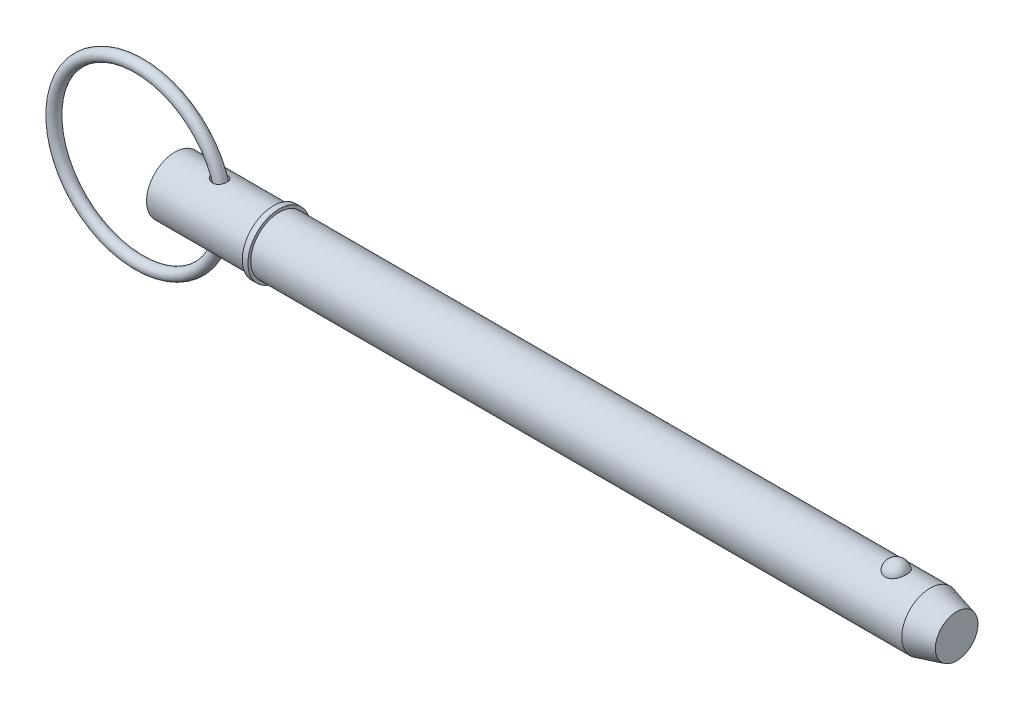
ISO-10303-21;
HEADER;
FILE_DESCRIPTION(('STEP AP214'),'2;1');
FILE_NAME('part.step','',(''),(''),'','','');
FILE_SCHEMA(('AUTOMOTIVE_DESIGN { 1 0 10303 214 1 1 1 1 }'));
ENDSEC;
DATA;
#1=APPLICATION_CONTEXT('core data for automotive mechanical design processes');
#2=APPLICATION_PROTOCOL_DEFINITION('international standard','automotive_design',2000,#1);
#3=PRODUCT_CONTEXT('',#1,'mechanical');
#4=PRODUCT('Part','Part','',(#3));
#5=PRODUCT_RELATED_PRODUCT_CATEGORY('part','',(#4));
#6=PRODUCT_DEFINITION_FORMATION('','',#4);
#7=PRODUCT_DEFINITION_CONTEXT('part definition',#1,'design');
#8=PRODUCT_DEFINITION('design','',#6,#7);
#9=PRODUCT_DEFINITION_SHAPE('','',#8);
#10=(LENGTH_UNIT() NAMED_UNIT(*) SI_UNIT(.MILLI.,.METRE.));
#11=(NAMED_UNIT(*) PLANE_ANGLE_UNIT() SI_UNIT($,.RADIAN.));
#12=(NAMED_UNIT(*) SI_UNIT($,.STERADIAN.) SOLID_ANGLE_UNIT());
#13=UNCERTAINTY_MEASURE_WITH_UNIT(LENGTH_MEASURE(1.E-05),#10,'distance_accuracy_value','');
#14=(GEOMETRIC_REPRESENTATION_CONTEXT(3) GLOBAL_UNCERTAINTY_ASSIGNED_CONTEXT((#13)) GLOBAL_UNIT_ASSIGNED_CONTEXT((#10,
#11,#12)) REPRESENTATION_CONTEXT('',''));
#15=CARTESIAN_POINT('',(0.,0.,0.));
#16=DIRECTION('',(0.,0.,1.));
#17=DIRECTION('',(1.,0.,0.));
#18=AXIS2_PLACEMENT_3D('',#15,#16,#17);
#19=CARTESIAN_POINT('',(-11.9894358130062,0.,0.));
#20=DIRECTION('',(0.,0.,1.));
#21=DIRECTION('',(1.,0.,0.));
#22=AXIS2_PLACEMENT_3D('',#19,#20,#21);
#23=TOROIDAL_SURFACE('',#22,28.575,1.905);
#24=CARTESIAN_POINT('',(18.4905641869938,0.,0.));
#25=VERTEX_POINT('',#24);
#26=VERTEX_LOOP('',#25);
#27=FACE_BOUND('',#26,.T.);
#28=ADVANCED_FACE('P0_F12',(#27),#23,.T.);
#29=CLOSED_SHELL('',(#28));
#30=MANIFOLD_SOLID_BREP('P0_B1',#29);
#31=CARTESIAN_POINT('',(0.,0.,0.));
#32=DIRECTION('',(1.,0.,0.));
#33=DIRECTION('',(0.,0.,-1.));
#34=AXIS2_PLACEMENT_3D('',#31,#32,#33);
#35=CYLINDRICAL_SURFACE('',#34,9.525);
#36=CARTESIAN_POINT('',(12.9513882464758,9.41921920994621,-1.41559473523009));
#37=CARTESIAN_POINT('',(13.0504692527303,9.40163924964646,-1.53256769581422));
#38=CARTESIAN_POINT('',(13.1602600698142,9.38319823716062,-1.6404459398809));
#39=CARTESIAN_POINT('',(13.3966485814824,9.34687220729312,-1.83618480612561));
#40=CARTESIAN_POINT('',(13.5232761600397,9.32898824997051,-1.92400906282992));
#41=CARTESIAN_POINT('',(13.78900694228,9.29593183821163,-2.07784697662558));
#42=CARTESIAN_POINT('',(13.9280753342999,9.28075215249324,-2.14391921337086));
#43=CARTESIAN_POINT('',(14.2153444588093,9.25488828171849,-2.25295850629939));
#44=CARTESIAN_POINT('',(14.3635415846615,9.24420233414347,-2.29593462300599));
#45=CARTESIAN_POINT('',(14.669669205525,9.22859713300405,-2.3579005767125));
#46=CARTESIAN_POINT('',(14.8277567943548,9.22385123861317,-2.37617053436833));
#47=CARTESIAN_POINT('',(15.1447573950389,9.22170813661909,-2.38448481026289));
#48=CARTESIAN_POINT('',(15.3036699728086,9.22430739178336,-2.3745427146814));
#49=CARTESIAN_POINT('',(15.6046561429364,9.2363636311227,-2.32717331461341));
#50=CARTESIAN_POINT('',(15.7470893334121,9.24528216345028,-2.29190131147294));
#51=CARTESIAN_POINT('',(16.0228763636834,9.26842607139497,-2.19642882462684));
#52=CARTESIAN_POINT('',(16.1562346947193,9.28264879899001,-2.1362407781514));
#53=CARTESIAN_POINT('',(16.3991522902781,9.31332263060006,-1.99805318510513));
#54=CARTESIAN_POINT('',(16.5097585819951,9.32951023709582,-1.92182839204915));
#55=CARTESIAN_POINT('',(16.7159974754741,9.36298467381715,-1.75147176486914));
#56=CARTESIAN_POINT('',(16.811631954,9.38027136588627,-1.65734217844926));
#57=CARTESIAN_POINT('',(16.9833240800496,9.41356881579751,-1.45618916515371));
#58=CARTESIAN_POINT('',(17.0597719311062,9.42959946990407,-1.34950141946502));
#59=CARTESIAN_POINT('',(17.1939538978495,9.45905380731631,-1.12462011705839));
#60=CARTESIAN_POINT('',(17.2516877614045,9.4724774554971,-1.00642640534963));
#61=CARTESIAN_POINT('',(17.3474400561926,9.49535683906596,-0.760990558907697));
#62=CARTESIAN_POINT('',(17.3853184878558,9.50478431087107,-0.633691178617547));
#63=CARTESIAN_POINT('',(17.4399027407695,9.51852575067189,-0.374363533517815));
#64=CARTESIAN_POINT('',(17.4566077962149,9.52283953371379,-0.242335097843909));
#65=CARTESIAN_POINT('',(17.4685150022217,9.52590431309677,0.0235692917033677));
#66=CARTESIAN_POINT('',(17.4635842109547,9.52462091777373,0.157451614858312));
#67=CARTESIAN_POINT('',(17.4320243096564,9.5165501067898,0.422467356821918));
#68=CARTESIAN_POINT('',(17.4053947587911,9.50976257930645,0.55360071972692));
#69=CARTESIAN_POINT('',(17.3310009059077,9.49140797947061,0.809490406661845));
#70=CARTESIAN_POINT('',(17.2832204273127,9.47983724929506,0.934241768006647));
#71=CARTESIAN_POINT('',(17.1676219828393,9.453180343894,1.1736825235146));
#72=CARTESIAN_POINT('',(17.0998044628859,9.43809424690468,1.28837214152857));
#73=CARTESIAN_POINT('',(16.9461013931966,9.40614962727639,1.50393386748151));
#74=CARTESIAN_POINT('',(16.8602910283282,9.38929862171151,1.6048606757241));
#75=CARTESIAN_POINT('',(16.6726759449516,9.35566510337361,1.79055313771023));
#76=CARTESIAN_POINT('',(16.5708731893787,9.33888258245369,1.87532077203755));
#77=CARTESIAN_POINT('',(16.3550631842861,9.30741331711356,2.02572386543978));
#78=CARTESIAN_POINT('',(16.2411701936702,9.29270956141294,2.09151983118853));
#79=CARTESIAN_POINT('',(16.0037488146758,9.26681293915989,2.20343355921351));
#80=CARTESIAN_POINT('',(15.8802207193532,9.25561996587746,2.24955191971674));
#81=CARTESIAN_POINT('',(15.6262451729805,9.23779438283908,2.32167613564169));
#82=CARTESIAN_POINT('',(15.4957570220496,9.23119272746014,2.34754561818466));
#83=CARTESIAN_POINT('',(15.2322153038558,9.22318493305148,2.37881082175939));
#84=CARTESIAN_POINT('',(15.0991611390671,9.22178001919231,2.38420171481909));
#85=CARTESIAN_POINT('',(14.8267609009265,9.22414647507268,2.37503099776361));
#86=CARTESIAN_POINT('',(14.6874545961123,9.22819578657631,2.35939810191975));
#87=CARTESIAN_POINT('',(14.412976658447,9.24129253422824,2.30756034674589));
#88=CARTESIAN_POINT('',(14.2778066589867,9.25034191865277,2.27134746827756));
#89=CARTESIAN_POINT('',(14.0027915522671,9.27334688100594,2.1756145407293));
#90=CARTESIAN_POINT('',(13.8635960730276,9.28766658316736,2.11431132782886));
#91=CARTESIAN_POINT('',(13.5969045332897,9.31925368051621,1.97041856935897));
#92=CARTESIAN_POINT('',(13.4694182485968,9.33652350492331,1.88781145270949));
#93=CARTESIAN_POINT('',(13.2243568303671,9.37286659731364,1.69844580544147));
#94=CARTESIAN_POINT('',(13.1075060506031,9.39198626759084,1.59075211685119));
#95=CARTESIAN_POINT('',(12.8957171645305,9.42881110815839,1.35544651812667));
#96=CARTESIAN_POINT('',(12.8007455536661,9.44651841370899,1.22786557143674));
#97=CARTESIAN_POINT('',(12.6580495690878,9.4741137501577,0.9887243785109));
#98=CARTESIAN_POINT('',(12.604453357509,9.4848570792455,0.880756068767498));
#99=CARTESIAN_POINT('',(12.515693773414,9.50295777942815,0.657225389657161));
#100=CARTESIAN_POINT('',(12.4805142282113,9.51031812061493,0.541669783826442));
#101=CARTESIAN_POINT('',(12.4305797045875,9.52083647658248,0.305475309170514));
#102=CARTESIAN_POINT('',(12.4159122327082,9.52397648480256,0.18481691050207));
#103=CARTESIAN_POINT('',(12.408320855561,9.52559626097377,-0.0572308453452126));
#104=CARTESIAN_POINT('',(12.4153963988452,9.52407614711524,-0.178620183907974));
#105=CARTESIAN_POINT('',(12.4495068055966,9.51684301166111,-0.409566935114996));
#106=CARTESIAN_POINT('',(12.4750931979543,9.51143444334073,-0.519353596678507));
#107=CARTESIAN_POINT('',(12.543120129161,9.49733710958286,-0.73328523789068));
#108=CARTESIAN_POINT('',(12.5855568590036,9.4886490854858,-0.837431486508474));
#109=CARTESIAN_POINT('',(12.6780792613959,9.47023833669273,-1.02356028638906));
#110=CARTESIAN_POINT('',(12.7261842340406,9.46084463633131,-1.10657511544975));
#111=CARTESIAN_POINT('',(12.8319313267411,9.44081892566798,-1.26610577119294));
#112=CARTESIAN_POINT('',(12.8895756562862,9.43018662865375,-1.34262008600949));
#113=CARTESIAN_POINT('',(12.9513882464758,9.41921920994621,-1.41559473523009));
#114=B_SPLINE_CURVE_WITH_KNOTS('',3,(#36,#37,#38,#39,#40,#41,#42,#43,#44,#45,#46,#47,#48,#49,
#50,#51,#52,#53,#54,#55,#56,#57,#58,#59,#60,#61,#62,#63,#64,#65,#66,#67,#68,#69,#70,#71,#72,#73,
#74,#75,#76,#77,#78,#79,#80,#81,#82,#83,#84,#85,#86,#87,#88,#89,#90,#91,#92,#93,#94,#95,#96,#97,
#98,#99,#100,#101,#102,#103,#104,#105,#106,#107,#108,#109,#110,#111,#112,#113),.UNSPECIFIED.,
.T.,.F.,(4,2,2,2,2,2,2,2,2,2,2,2,2,2,2,2,2,2,2,2,2,2,2,2,2,2,2,2,2,2,2,2,2,2,2,2,2,2,4),(0.,
0.462524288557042,0.925880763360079,1.3879789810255,1.8498957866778,2.3250010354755,
2.79987752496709,3.23851602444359,3.67693583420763,4.08084875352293,4.48471100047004,
4.87953549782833,5.27436531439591,5.67194282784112,6.0695347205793,6.46957303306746,
6.86961947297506,7.26997240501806,7.67031642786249,8.06901977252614,8.46767421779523,
8.86284969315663,9.25801315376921,9.65581560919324,10.0537118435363,10.4726706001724,
10.8917927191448,11.3481090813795,11.8048030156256,12.2824769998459,12.7594145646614,
13.1209614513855,13.4821903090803,13.8449555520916,14.2077115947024,14.5447865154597,
14.881785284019,15.170268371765,15.4588183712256),.UNSPECIFIED.);
#115=CARTESIAN_POINT('',(12.9513882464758,9.41921920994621,-1.41559473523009));
#116=VERTEX_POINT('',#115);
#117=EDGE_CURVE('P1_E42',#116,#116,#114,.T.);
#118=ORIENTED_EDGE('',*,*,#117,.T.);
#119=EDGE_LOOP('',(#118));
#120=FACE_BOUND('',#119,.T.);
#121=CARTESIAN_POINT('',(0.,0.,0.));
#122=DIRECTION('',(1.,0.,0.));
#123=DIRECTION('',(0.,0.,-1.));
#124=AXIS2_PLACEMENT_3D('',#121,#122,#123);
#125=CIRCLE('',#124,9.525);
#126=CARTESIAN_POINT('',(0.,0.,-9.525));
#127=VERTEX_POINT('',#126);
#128=EDGE_CURVE('P1_E9',#127,#127,#125,.T.);
#129=ORIENTED_EDGE('',*,*,#128,.T.);
#130=EDGE_LOOP('',(#129));
#131=FACE_BOUND('',#130,.T.);
#132=CARTESIAN_POINT('',(33.025,0.,0.));
#133=DIRECTION('',(1.,0.,0.));
#134=DIRECTION('',(0.,0.,-1.));
#135=AXIS2_PLACEMENT_3D('',#132,#133,#134);
#136=CIRCLE('',#135,9.525);
#137=CARTESIAN_POINT('',(33.025,0.,-9.525));
#138=VERTEX_POINT('',#137);
#139=EDGE_CURVE('P1_E25',#138,#138,#136,.T.);
#140=ORIENTED_EDGE('',*,*,#139,.F.);
#141=EDGE_LOOP('',(#140));
#142=FACE_BOUND('',#141,.T.);
#143=CARTESIAN_POINT('',(12.9513882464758,-9.41921920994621,-1.41559473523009));
#144=CARTESIAN_POINT('',(12.8706569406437,-9.43354320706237,-1.32028288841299));
#145=CARTESIAN_POINT('',(12.7970077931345,-9.44729974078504,-1.21890449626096));
#146=CARTESIAN_POINT('',(12.6667099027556,-9.47239055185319,-1.00546491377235));
#147=CARTESIAN_POINT('',(12.6100480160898,-9.48372669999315,-0.893412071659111));
#148=CARTESIAN_POINT('',(12.5163428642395,-9.50281544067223,-0.66020233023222));
#149=CARTESIAN_POINT('',(12.4794216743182,-9.51054569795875,-0.538993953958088));
#150=CARTESIAN_POINT('',(12.4282252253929,-9.52133525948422,-0.29167282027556));
#151=CARTESIAN_POINT('',(12.4139371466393,-9.52439720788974,-0.165562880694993));
#152=CARTESIAN_POINT('',(12.4092595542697,-9.52539668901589,0.0763263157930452));
#153=CARTESIAN_POINT('',(12.4169377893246,-9.5237485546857,0.192070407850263));
#154=CARTESIAN_POINT('',(12.4515961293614,-9.51640070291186,0.420478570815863));
#155=CARTESIAN_POINT('',(12.4785770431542,-9.51070081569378,0.533142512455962));
#156=CARTESIAN_POINT('',(12.5496371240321,-9.49599978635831,0.750537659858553));
#157=CARTESIAN_POINT('',(12.5934215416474,-9.48705569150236,0.855370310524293));
#158=CARTESIAN_POINT('',(12.6960201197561,-9.46670226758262,1.05710432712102));
#159=CARTESIAN_POINT('',(12.754838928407,-9.45529217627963,1.15400322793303));
#160=CARTESIAN_POINT('',(12.8926588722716,-9.42958102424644,1.34883014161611));
#161=CARTESIAN_POINT('',(12.9731843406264,-9.41509922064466,1.44565277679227));
#162=CARTESIAN_POINT('',(13.1473692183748,-9.38554264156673,1.62653953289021));
#163=CARTESIAN_POINT('',(13.2410364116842,-9.37046751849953,1.71059603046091));
#164=CARTESIAN_POINT('',(13.4543924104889,-9.33867330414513,1.87697964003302));
#165=CARTESIAN_POINT('',(13.5758667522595,-9.32205896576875,1.95704323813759));
#166=CARTESIAN_POINT('',(13.8299208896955,-9.29140277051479,2.09777392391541));
#167=CARTESIAN_POINT('',(13.9625074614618,-9.27736250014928,2.15842906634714));
#168=CARTESIAN_POINT('',(14.2477938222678,-9.25234849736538,2.26337318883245));
#169=CARTESIAN_POINT('',(14.4012368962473,-9.2417532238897,2.30575283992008));
#170=CARTESIAN_POINT('',(14.7134258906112,-9.22706044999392,2.36387471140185));
#171=CARTESIAN_POINT('',(14.8721705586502,-9.22296142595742,2.37962317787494));
#172=CARTESIAN_POINT('',(15.1841930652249,-9.22219798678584,2.38258156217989));
#173=CARTESIAN_POINT('',(15.3374581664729,-9.22526675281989,2.37081567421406));
#174=CARTESIAN_POINT('',(15.6390558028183,-9.23821642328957,2.31984408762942));
#175=CARTESIAN_POINT('',(15.7873916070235,-9.24809271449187,2.28065697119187));
#176=CARTESIAN_POINT('',(16.0605055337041,-9.27231045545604,2.17997072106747));
#177=CARTESIAN_POINT('',(16.1861988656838,-9.28616347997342,2.12082794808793));
#178=CARTESIAN_POINT('',(16.4248737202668,-9.31689725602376,1.9814435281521));
#179=CARTESIAN_POINT('',(16.5378583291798,-9.33377726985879,1.90120701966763));
#180=CARTESIAN_POINT('',(16.7424913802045,-9.36766057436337,1.72629138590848));
#181=CARTESIAN_POINT('',(16.8349077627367,-9.38461836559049,1.63249912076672));
#182=CARTESIAN_POINT('',(17.0025959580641,-9.41752009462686,1.43052052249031));
#183=CARTESIAN_POINT('',(17.0778684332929,-9.43346407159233,1.32233474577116));
#184=CARTESIAN_POINT('',(17.2093311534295,-9.46256896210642,1.09477833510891));
#185=CARTESIAN_POINT('',(17.2655443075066,-9.47573320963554,0.975421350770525));
#186=CARTESIAN_POINT('',(17.3577240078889,-9.49788660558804,0.728764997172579));
#187=CARTESIAN_POINT('',(17.3936897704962,-9.5068755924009,0.601465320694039));
#188=CARTESIAN_POINT('',(17.4447894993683,-9.51977728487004,0.341392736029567));
#189=CARTESIAN_POINT('',(17.4597470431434,-9.52364698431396,0.208583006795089));
#190=CARTESIAN_POINT('',(17.467935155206,-9.52575588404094,-0.0577507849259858));
#191=CARTESIAN_POINT('',(17.4611651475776,-9.52399493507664,-0.191274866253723));
#192=CARTESIAN_POINT('',(17.4259933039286,-9.51501704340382,-0.455658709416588));
#193=CARTESIAN_POINT('',(17.3975278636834,-9.50778405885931,-0.586509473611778));
#194=CARTESIAN_POINT('',(17.3195245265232,-9.48862442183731,-0.841413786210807));
#195=CARTESIAN_POINT('',(17.2699864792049,-9.47669773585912,-0.965467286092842));
#196=CARTESIAN_POINT('',(17.1510794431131,-9.44947793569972,-1.20302860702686));
#197=CARTESIAN_POINT('',(17.0817421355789,-9.43419020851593,-1.31655289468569));
#198=CARTESIAN_POINT('',(16.9249035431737,-9.40193593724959,-1.52999797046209));
#199=CARTESIAN_POINT('',(16.8374037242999,-9.38496952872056,-1.62991985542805));
#200=CARTESIAN_POINT('',(16.6472525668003,-9.35139745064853,-1.81261591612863));
#201=CARTESIAN_POINT('',(16.544718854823,-9.33479003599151,-1.89551219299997));
#202=CARTESIAN_POINT('',(16.3268885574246,-9.30366076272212,-2.04284430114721));
#203=CARTESIAN_POINT('',(16.2115933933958,-9.28913867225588,-2.10728218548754));
#204=CARTESIAN_POINT('',(15.9721327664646,-9.26380878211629,-2.21598517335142));
#205=CARTESIAN_POINT('',(15.8480095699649,-9.25298455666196,-2.26033977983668));
#206=CARTESIAN_POINT('',(15.5939970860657,-9.23601616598,-2.32870721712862));
#207=CARTESIAN_POINT('',(15.4641070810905,-9.22987258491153,-2.35271750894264));
#208=CARTESIAN_POINT('',(15.1982340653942,-9.22261892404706,-2.38099747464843));
#209=CARTESIAN_POINT('',(15.0621840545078,-9.22166165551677,-2.38466791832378));
#210=CARTESIAN_POINT('',(14.7911713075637,-9.22504733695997,-2.37153091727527));
#211=CARTESIAN_POINT('',(14.6562088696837,-9.2293916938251,-2.35471803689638));
#212=CARTESIAN_POINT('',(14.3799999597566,-9.24325361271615,-2.29972931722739));
#213=CARTESIAN_POINT('',(14.2390842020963,-9.25314817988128,-2.2599897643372));
#214=CARTESIAN_POINT('',(13.9651910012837,-9.27709186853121,-2.15959208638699));
#215=CARTESIAN_POINT('',(13.8322212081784,-9.29114491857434,-2.09891417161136));
#216=CARTESIAN_POINT('',(13.5621642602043,-9.32369066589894,-1.94960068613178));
#217=CARTESIAN_POINT('',(13.4264724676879,-9.34251276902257,-1.85849626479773));
#218=CARTESIAN_POINT('',(13.1736579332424,-9.38095091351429,-1.6535412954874));
#219=CARTESIAN_POINT('',(13.0565182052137,-9.40056620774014,-1.53971177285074));
#220=CARTESIAN_POINT('',(12.9513882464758,-9.41921920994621,-1.41559473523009));
#221=B_SPLINE_CURVE_WITH_KNOTS('',3,(#143,#144,#145,#146,#147,#148,#149,#150,#151,#152,#153,
#154,#155,#156,#157,#158,#159,#160,#161,#162,#163,#164,#165,#166,#167,#168,#169,#170,#171,#172,
#173,#174,#175,#176,#177,#178,#179,#180,#181,#182,#183,#184,#185,#186,#187,#188,#189,#190,#191,
#192,#193,#194,#195,#196,#197,#198,#199,#200,#201,#202,#203,#204,#205,#206,#207,#208,#209,#210,
#211,#212,#213,#214,#215,#216,#217,#218,#219,#220),.UNSPECIFIED.,.T.,.F.,(4,2,2,2,2,2,2,2,2,2,2,
2,2,2,2,2,2,2,2,2,2,2,2,2,2,2,2,2,2,2,2,2,2,2,2,2,2,2,4),(0.,0.376746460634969,0.75320065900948,
1.13195666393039,1.51049805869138,1.85679105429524,2.20309856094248,2.54359033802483,
2.88418751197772,3.26301611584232,3.64207005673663,4.07954912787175,4.51729693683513,
4.99355673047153,5.46970480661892,5.92841231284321,6.38680927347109,6.80346940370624,
7.22002812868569,7.61642768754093,8.01281192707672,8.40871801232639,8.80463942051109,
9.20386620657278,9.60310357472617,10.0035159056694,10.4039310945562,10.8037091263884,
11.2034549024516,11.6002252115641,11.9969513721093,12.3918916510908,12.7868812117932,
13.1934480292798,13.6001227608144,14.038511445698,14.4773156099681,14.9683748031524,
15.4589817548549),.UNSPECIFIED.);
#222=CARTESIAN_POINT('',(12.9513882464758,-9.41921920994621,-1.41559473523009));
#223=VERTEX_POINT('',#222);
#224=EDGE_CURVE('P1_E17',#223,#223,#221,.T.);
#225=ORIENTED_EDGE('',*,*,#224,.T.);
#226=EDGE_LOOP('',(#225));
#227=FACE_BOUND('',#226,.T.);
#228=ADVANCED_FACE('P1_F13',(#120,#131,#142,#227),#35,.T.);
#229=CARTESIAN_POINT('',(0.,0.,0.));
#230=DIRECTION('',(1.,0.,0.));
#231=DIRECTION('',(0.,0.,-1.));
#232=AXIS2_PLACEMENT_3D('',#229,#230,#231);
#233=CYLINDRICAL_SURFACE('',#232,9.525);
#234=CARTESIAN_POINT('',(253.043054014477,0.,0.));
#235=DIRECTION('',(1.,0.,0.));
#236=DIRECTION('',(0.,0.,-1.));
#237=AXIS2_PLACEMENT_3D('',#234,#235,#236);
#238=CIRCLE('',#237,9.525);
#239=CARTESIAN_POINT('',(253.043054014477,0.,-9.525));
#240=VERTEX_POINT('',#239);
#241=EDGE_CURVE('P1_E99',#240,#240,#238,.T.);
#242=ORIENTED_EDGE('',*,*,#241,.F.);
#243=EDGE_LOOP('',(#242));
#244=FACE_BOUND('',#243,.T.);
#245=CARTESIAN_POINT('',(34.93,0.,0.));
#246=DIRECTION('',(1.,0.,0.));
#247=DIRECTION('',(0.,0.,-1.));
#248=AXIS2_PLACEMENT_3D('',#245,#246,#247);
#249=CIRCLE('',#248,9.525);
#250=CARTESIAN_POINT('',(34.93,0.,-9.525));
#251=VERTEX_POINT('',#250);
#252=EDGE_CURVE('P1_E96',#251,#251,#249,.T.);
#253=ORIENTED_EDGE('',*,*,#252,.T.);
#254=EDGE_LOOP('',(#253));
#255=FACE_BOUND('',#254,.T.);
#256=CARTESIAN_POINT('',(241.645757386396,8.80405803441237,3.63513233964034));
#257=CARTESIAN_POINT('',(241.551676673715,8.80405953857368,3.63513053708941));
#258=CARTESIAN_POINT('',(241.457561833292,8.80561325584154,3.63137461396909));
#259=CARTESIAN_POINT('',(241.270012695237,8.81177748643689,3.61638665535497));
#260=CARTESIAN_POINT('',(241.176578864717,8.81638992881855,3.60514990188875));
#261=CARTESIAN_POINT('',(240.897945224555,8.83467114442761,3.56024627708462));
#262=CARTESIAN_POINT('',(240.714691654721,8.85278327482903,3.51538626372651));
#263=CARTESIAN_POINT('',(240.359509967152,8.89871214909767,3.39742145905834));
#264=CARTESIAN_POINT('',(240.187553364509,8.92650327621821,3.32439116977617));
#265=CARTESIAN_POINT('',(239.858707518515,8.98874819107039,3.15220244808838));
#266=CARTESIAN_POINT('',(239.701811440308,9.02319893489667,3.05305594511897));
#267=CARTESIAN_POINT('',(239.402214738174,9.09629186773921,2.82797815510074));
#268=CARTESIAN_POINT('',(239.260060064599,9.13502685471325,2.70135138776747));
#269=CARTESIAN_POINT('',(238.998299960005,9.21186572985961,2.42641932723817));
#270=CARTESIAN_POINT('',(238.878701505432,9.24996941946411,2.27810735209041));
#271=CARTESIAN_POINT('',(238.659645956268,9.32341082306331,1.95652290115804));
#272=CARTESIAN_POINT('',(238.561317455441,9.35855090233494,1.78243511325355));
#273=CARTESIAN_POINT('',(238.393819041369,9.42045142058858,1.419372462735));
#274=CARTESIAN_POINT('',(238.324651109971,9.44721128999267,1.23039658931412));
#275=CARTESIAN_POINT('',(238.216199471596,9.48990641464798,0.840370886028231));
#276=CARTESIAN_POINT('',(238.177288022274,9.50570658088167,0.639202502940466));
#277=CARTESIAN_POINT('',(238.131555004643,9.52433146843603,0.232664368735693));
#278=CARTESIAN_POINT('',(238.124732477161,9.52715657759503,0.0272947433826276));
#279=CARTESIAN_POINT('',(238.143255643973,9.51956918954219,-0.380478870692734));
#280=CARTESIAN_POINT('',(238.168405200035,9.50923740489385,-0.582893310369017));
#281=CARTESIAN_POINT('',(238.25002537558,9.47651897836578,-0.980293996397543));
#282=CARTESIAN_POINT('',(238.306496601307,9.45413210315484,-1.17528009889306));
#283=CARTESIAN_POINT('',(238.449719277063,9.39954044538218,-1.55263697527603));
#284=CARTESIAN_POINT('',(238.536512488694,9.36732213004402,-1.73498993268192));
#285=CARTESIAN_POINT('',(238.738610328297,9.29640700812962,-2.08177763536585));
#286=CARTESIAN_POINT('',(238.853917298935,9.25770966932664,-2.24621090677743));
#287=CARTESIAN_POINT('',(239.111264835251,9.17775604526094,-2.55338333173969));
#288=CARTESIAN_POINT('',(239.253434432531,9.136488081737,-2.69601150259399));
#289=CARTESIAN_POINT('',(239.56089985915,9.05620497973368,-2.95451229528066));
#290=CARTESIAN_POINT('',(239.726193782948,9.01718965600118,-3.070387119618));
#291=CARTESIAN_POINT('',(240.072052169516,8.94680019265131,-3.26976836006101));
#292=CARTESIAN_POINT('',(240.252227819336,8.91528408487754,-3.35389750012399));
#293=CARTESIAN_POINT('',(240.625651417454,8.86272514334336,-3.49043503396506));
#294=CARTESIAN_POINT('',(240.818894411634,8.84167836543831,-3.54285537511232));
#295=CARTESIAN_POINT('',(241.202503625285,8.81348056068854,-3.61241306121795));
#296=CARTESIAN_POINT('',(241.392525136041,8.80568348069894,-3.6311933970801));
#297=CARTESIAN_POINT('',(241.773190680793,8.80289410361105,-3.63795342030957));
#298=CARTESIAN_POINT('',(241.963834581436,8.80789922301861,-3.62593932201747));
#299=CARTESIAN_POINT('',(242.334007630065,8.82974915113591,-3.57238430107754));
#300=CARTESIAN_POINT('',(242.513697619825,8.84621463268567,-3.53178890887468));
#301=CARTESIAN_POINT('',(242.863422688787,8.88875330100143,-3.42331083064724));
#302=CARTESIAN_POINT('',(243.033456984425,8.91482726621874,-3.35542593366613));
#303=CARTESIAN_POINT('',(243.363237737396,8.97448239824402,-3.19248225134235));
#304=CARTESIAN_POINT('',(243.522680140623,9.00821446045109,-3.0968647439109));
#305=CARTESIAN_POINT('',(243.823513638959,9.07935398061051,-2.88162736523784));
#306=CARTESIAN_POINT('',(243.964900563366,9.11676228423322,-2.76200196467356));
#307=CARTESIAN_POINT('',(244.23331931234,9.19347419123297,-2.49516285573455));
#308=CARTESIAN_POINT('',(244.359275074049,9.23277872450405,-2.34686614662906));
#309=CARTESIAN_POINT('',(244.585522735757,9.3073761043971,-2.0309368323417));
#310=CARTESIAN_POINT('',(244.68581004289,9.34266823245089,-1.86330077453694));
#311=CARTESIAN_POINT('',(244.861514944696,9.40674710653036,-1.50744893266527));
#312=CARTESIAN_POINT('',(244.936041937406,9.43529176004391,-1.31874876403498));
#313=CARTESIAN_POINT('',(245.05416505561,9.48144132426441,-0.930631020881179));
#314=CARTESIAN_POINT('',(245.097760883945,9.49904612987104,-0.731213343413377));
#315=CARTESIAN_POINT('',(245.153158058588,9.5215314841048,-0.327147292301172));
#316=CARTESIAN_POINT('',(245.164935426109,9.52640243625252,-0.122495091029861));
#317=CARTESIAN_POINT('',(245.156382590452,9.5228957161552,0.28601848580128));
#318=CARTESIAN_POINT('',(245.13605305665,9.5145183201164,0.489879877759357));
#319=CARTESIAN_POINT('',(245.063884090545,9.48544083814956,0.889994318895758));
#320=CARTESIAN_POINT('',(245.012199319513,9.46480124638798,1.08627971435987));
#321=CARTESIAN_POINT('',(244.878491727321,9.4133389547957,1.46682086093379));
#322=CARTESIAN_POINT('',(244.796466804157,9.38251554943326,1.65107577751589));
#323=CARTESIAN_POINT('',(244.60319292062,9.31365636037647,2.00346348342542));
#324=CARTESIAN_POINT('',(244.491783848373,9.27558138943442,2.17150083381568));
#325=CARTESIAN_POINT('',(244.242294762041,9.19638714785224,2.48563115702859));
#326=CARTESIAN_POINT('',(244.104216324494,9.15526805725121,2.63172542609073));
#327=CARTESIAN_POINT('',(243.804843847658,9.07465393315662,2.89750997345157));
#328=CARTESIAN_POINT('',(243.643610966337,9.03515496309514,3.01726776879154));
#329=CARTESIAN_POINT('',(243.301613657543,8.96227564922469,3.22732920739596));
#330=CARTESIAN_POINT('',(243.120841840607,8.92889763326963,3.31762165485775));
#331=CARTESIAN_POINT('',(242.751445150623,8.8734538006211,3.46314419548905));
#332=CARTESIAN_POINT('',(242.56332371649,8.85102983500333,3.51950082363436));
#333=CARTESIAN_POINT('',(242.27578699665,8.82666967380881,3.57993683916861));
#334=CARTESIAN_POINT('',(242.179133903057,8.82009725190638,3.5960621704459));
#335=CARTESIAN_POINT('',(241.984677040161,8.81020897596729,3.62022512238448));
#336=CARTESIAN_POINT('',(241.88687410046,8.80689090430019,3.62826825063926));
#337=CARTESIAN_POINT('',(241.741224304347,8.80445615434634,3.63416760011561));
#338=CARTESIAN_POINT('',(241.693495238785,8.80405727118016,3.63513325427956));
#339=CARTESIAN_POINT('',(241.645757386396,8.80405803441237,3.63513233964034));
#340=B_SPLINE_CURVE_WITH_KNOTS('',3,(#256,#257,#258,#259,#260,#261,#262,#263,#264,#265,#266,
#267,#268,#269,#270,#271,#272,#273,#274,#275,#276,#277,#278,#279,#280,#281,#282,#283,#284,#285,
#286,#287,#288,#289,#290,#291,#292,#293,#294,#295,#296,#297,#298,#299,#300,#301,#302,#303,#304,
#305,#306,#307,#308,#309,#310,#311,#312,#313,#314,#315,#316,#317,#318,#319,#320,#321,#322,#323,
#324,#325,#326,#327,#328,#329,#330,#331,#332,#333,#334,#335,#336,#337,#338,#339),.UNSPECIFIED.,
.T.,.F.,(4,2,2,2,2,2,2,2,2,2,2,2,2,2,2,2,2,2,2,2,2,2,2,2,2,2,2,2,2,2,2,2,2,2,2,2,2,2,2,2,2,4),
(0.,0.282202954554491,0.564584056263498,1.13017050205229,1.69427128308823,2.25811483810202,
2.83836627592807,3.41879688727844,4.02497117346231,4.63118665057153,5.24474754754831,
5.85829010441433,6.46808687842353,7.07789545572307,7.6885472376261,8.299249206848,
8.91296283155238,9.52662591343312,10.1275338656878,10.7282152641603,11.2986646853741,
11.8689989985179,12.4213015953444,12.973648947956,13.5380053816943,14.1024919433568,
14.695298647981,15.2882113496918,15.8999469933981,16.5116885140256,17.1238909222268,
17.7360805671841,18.3452748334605,18.9545113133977,19.567138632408,20.179729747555,
20.7907316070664,21.4019653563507,21.9915938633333,22.2859053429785,22.5800161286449,
22.7232098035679),.UNSPECIFIED.);
#341=CARTESIAN_POINT('',(241.645757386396,8.80405803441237,3.63513233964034));
#342=VERTEX_POINT('',#341);
#343=EDGE_CURVE('P1_E34',#342,#342,#340,.T.);
#344=ORIENTED_EDGE('',*,*,#343,.T.);
#345=EDGE_LOOP('',(#344));
#346=FACE_BOUND('',#345,.T.);
#347=ADVANCED_FACE('P1_F46',(#244,#255,#346),#233,.T.);
#348=CARTESIAN_POINT('',(0.,0.,0.));
#349=DIRECTION('',(-1.,0.,0.));
#350=DIRECTION('',(0.,0.,1.));
#351=AXIS2_PLACEMENT_3D('',#348,#349,#350);
#352=PLANE('',#351);
#353=ORIENTED_EDGE('',*,*,#128,.F.);
#354=EDGE_LOOP('',(#353));
#355=FACE_BOUND('',#354,.T.);
#356=ADVANCED_FACE('P1_F15',(#355),#352,.T.);
#357=CARTESIAN_POINT('',(33.025,9.525,0.));
#358=DIRECTION('',(-1.,0.,0.));
#359=DIRECTION('',(0.,0.,1.));
#360=AXIS2_PLACEMENT_3D('',#357,#358,#359);
#361=PLANE('',#360);
#362=ORIENTED_EDGE('',*,*,#139,.T.);
#363=EDGE_LOOP('',(#362));
#364=FACE_BOUND('',#363,.T.);
#365=CARTESIAN_POINT('',(33.025,0.,0.));
#366=DIRECTION('',(1.,0.,0.));
#367=DIRECTION('',(0.,0.,-1.));
#368=AXIS2_PLACEMENT_3D('',#365,#366,#367);
#369=CIRCLE('',#368,10.4775);
#370=CARTESIAN_POINT('',(33.025,0.,-10.4775));
#371=VERTEX_POINT('',#370);
#372=EDGE_CURVE('P1_E30',#371,#371,#369,.T.);
#373=ORIENTED_EDGE('',*,*,#372,.F.);
#374=EDGE_LOOP('',(#373));
#375=FACE_BOUND('',#374,.T.);
#376=ADVANCED_FACE('P1_F81',(#364,#375),#361,.T.);
#377=CARTESIAN_POINT('',(0.,0.,0.));
#378=DIRECTION('',(1.,0.,0.));
#379=DIRECTION('',(0.,0.,-1.));
#380=AXIS2_PLACEMENT_3D('',#377,#378,#379);
#381=CYLINDRICAL_SURFACE('',#380,10.4775);
#382=ORIENTED_EDGE('',*,*,#372,.T.);
#383=EDGE_LOOP('',(#382));
#384=FACE_BOUND('',#383,.T.);
#385=CARTESIAN_POINT('',(34.93,0.,0.));
#386=DIRECTION('',(1.,0.,0.));
#387=DIRECTION('',(0.,0.,-1.));
#388=AXIS2_PLACEMENT_3D('',#385,#386,#387);
#389=CIRCLE('',#388,10.4775);
#390=CARTESIAN_POINT('',(34.93,0.,-10.4775));
#391=VERTEX_POINT('',#390);
#392=EDGE_CURVE('P1_E95',#391,#391,#389,.T.);
#393=ORIENTED_EDGE('',*,*,#392,.F.);
#394=EDGE_LOOP('',(#393));
#395=FACE_BOUND('',#394,.T.);
#396=ADVANCED_FACE('P1_F68',(#384,#395),#381,.T.);
#397=CARTESIAN_POINT('',(34.93,10.4775,0.));
#398=DIRECTION('',(1.,0.,0.));
#399=DIRECTION('',(0.,0.,-1.));
#400=AXIS2_PLACEMENT_3D('',#397,#398,#399);
#401=PLANE('',#400);
#402=ORIENTED_EDGE('',*,*,#392,.T.);
#403=EDGE_LOOP('',(#402));
#404=FACE_BOUND('',#403,.T.);
#405=ORIENTED_EDGE('',*,*,#252,.F.);
#406=EDGE_LOOP('',(#405));
#407=FACE_BOUND('',#406,.T.);
#408=ADVANCED_FACE('P1_F62',(#404,#407),#401,.T.);
#409=CARTESIAN_POINT('',(261.93,0.,0.));
#410=DIRECTION('',(-1.,0.,0.));
#411=DIRECTION('',(0.,0.,1.));
#412=AXIS2_PLACEMENT_3D('',#409,#410,#411);
#413=CONICAL_SURFACE('',#412,7.14375000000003,0.261799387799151);
#414=ORIENTED_EDGE('',*,*,#241,.T.);
#415=EDGE_LOOP('',(#414));
#416=FACE_BOUND('',#415,.T.);
#417=CARTESIAN_POINT('',(261.93,0.,0.));
#418=DIRECTION('',(1.,0.,0.));
#419=DIRECTION('',(0.,0.,-1.));
#420=AXIS2_PLACEMENT_3D('',#417,#418,#419);
#421=CIRCLE('',#420,7.14375000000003);
#422=CARTESIAN_POINT('',(261.93,0.,-7.14375000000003));
#423=VERTEX_POINT('',#422);
#424=EDGE_CURVE('P1_E41',#423,#423,#421,.T.);
#425=ORIENTED_EDGE('',*,*,#424,.F.);
#426=EDGE_LOOP('',(#425));
#427=FACE_BOUND('',#426,.T.);
#428=ADVANCED_FACE('P1_F59',(#416,#427),#413,.T.);
#429=CARTESIAN_POINT('',(261.93,7.14375000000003,0.));
#430=DIRECTION('',(1.,0.,0.));
#431=DIRECTION('',(0.,0.,-1.));
#432=AXIS2_PLACEMENT_3D('',#429,#430,#431);
#433=PLANE('',#432);
#434=ORIENTED_EDGE('',*,*,#424,.T.);
#435=EDGE_LOOP('',(#434));
#436=FACE_BOUND('',#435,.T.);
#437=ADVANCED_FACE('P1_F55',(#436),#433,.T.);
#438=CARTESIAN_POINT('',(241.645757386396,8.5725,0.));
#439=DIRECTION('',(-1.,0.,0.));
#440=DIRECTION('',(0.,-1.,0.));
#441=AXIS2_PLACEMENT_3D('',#438,#439,#440);
#442=SPHERICAL_SURFACE('',#441,3.64249999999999);
#443=ORIENTED_EDGE('',*,*,#343,.F.);
#444=EDGE_LOOP('',(#443));
#445=FACE_BOUND('',#444,.T.);
#446=ADVANCED_FACE('P1_F50',(#445),#442,.T.);
#447=CARTESIAN_POINT('',(-11.9894358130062,0.,0.));
#448=DIRECTION('',(0.,0.,1.));
#449=DIRECTION('',(1.,0.,0.));
#450=AXIS2_PLACEMENT_3D('',#447,#448,#449);
#451=TOROIDAL_SURFACE('',#450,28.575,2.38125);
#452=ORIENTED_EDGE('',*,*,#224,.F.);
#453=EDGE_LOOP('',(#452));
#454=FACE_BOUND('',#453,.T.);
#455=ORIENTED_EDGE('',*,*,#117,.F.);
#456=EDGE_LOOP('',(#455));
#457=FACE_BOUND('',#456,.T.);
#458=ADVANCED_FACE('P1_F54',(#454,#457),#451,.F.);
#459=CLOSED_SHELL('',(#228,#347,#356,#376,#396,#408,#428,#437,#446,#458));
#460=MANIFOLD_SOLID_BREP('P1_B1',#459);
#461=ADVANCED_BREP_SHAPE_REPRESENTATION('',(#18,#30,#460),#14);
#462=SHAPE_DEFINITION_REPRESENTATION(#9,#461);
ENDSEC;
END-ISO-10303-21;
